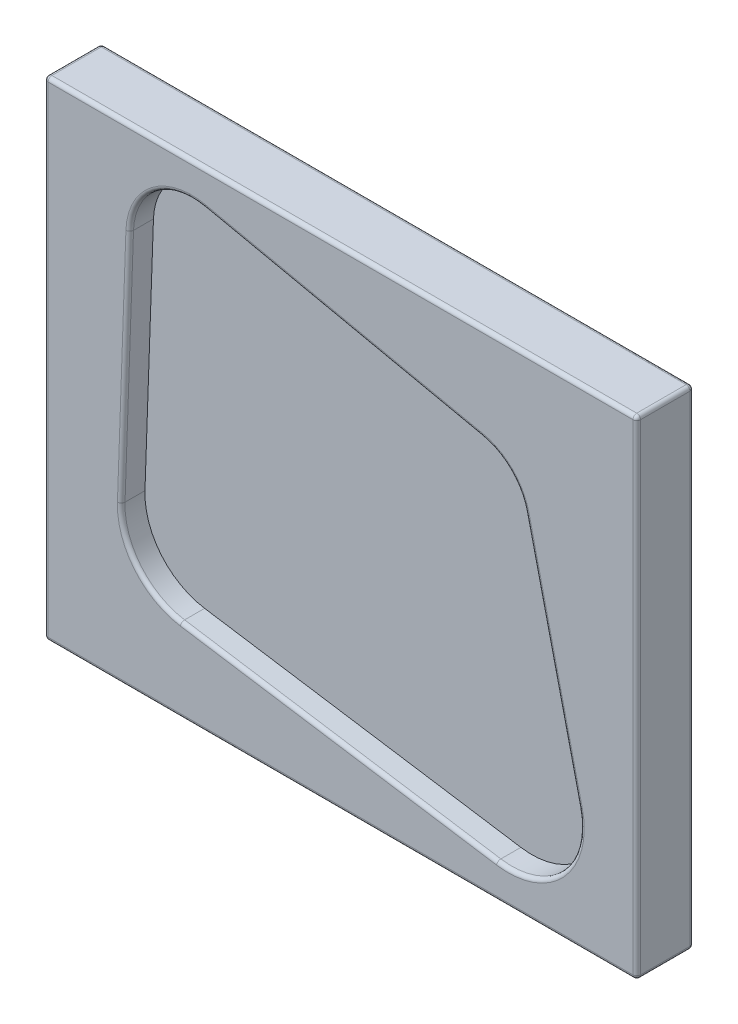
ISO-10303-21;
HEADER;
FILE_DESCRIPTION(('STEP AP214'),'2;1');
FILE_NAME('part.step','',(''),(''),'','','');
FILE_SCHEMA(('AUTOMOTIVE_DESIGN { 1 0 10303 214 1 1 1 1 }'));
ENDSEC;
DATA;
#1=APPLICATION_CONTEXT('core data for automotive mechanical design processes');
#2=APPLICATION_PROTOCOL_DEFINITION('international standard','automotive_design',2000,#1);
#3=PRODUCT_CONTEXT('',#1,'mechanical');
#4=PRODUCT('Part','Part','',(#3));
#5=PRODUCT_RELATED_PRODUCT_CATEGORY('part','',(#4));
#6=PRODUCT_DEFINITION_FORMATION('','',#4);
#7=PRODUCT_DEFINITION_CONTEXT('part definition',#1,'design');
#8=PRODUCT_DEFINITION('design','',#6,#7);
#9=PRODUCT_DEFINITION_SHAPE('','',#8);
#10=(LENGTH_UNIT() NAMED_UNIT(*) SI_UNIT(.MILLI.,.METRE.));
#11=(NAMED_UNIT(*) PLANE_ANGLE_UNIT() SI_UNIT($,.RADIAN.));
#12=(NAMED_UNIT(*) SI_UNIT($,.STERADIAN.) SOLID_ANGLE_UNIT());
#13=UNCERTAINTY_MEASURE_WITH_UNIT(LENGTH_MEASURE(1.E-05),#10,'distance_accuracy_value','');
#14=(GEOMETRIC_REPRESENTATION_CONTEXT(3) GLOBAL_UNCERTAINTY_ASSIGNED_CONTEXT((#13)) GLOBAL_UNIT_ASSIGNED_CONTEXT((#10,
#11,#12)) REPRESENTATION_CONTEXT('',''));
#15=CARTESIAN_POINT('',(0.,0.,0.));
#16=DIRECTION('',(0.,0.,1.));
#17=DIRECTION('',(1.,0.,0.));
#18=AXIS2_PLACEMENT_3D('',#15,#16,#17);
#19=CARTESIAN_POINT('',(128.820181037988,771.782439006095,-76.2));
#20=DIRECTION('',(-1.,0.,0.));
#21=DIRECTION('',(0.,-1.,0.));
#22=AXIS2_PLACEMENT_3D('',#19,#20,#21);
#23=PLANE('',#22);
#24=DIRECTION('',(0.,0.,1.));
#25=VECTOR('',#24,1.);
#26=CARTESIAN_POINT('',(128.820181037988,766.702439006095,-76.2));
#27=LINE('',#26,#25);
#28=CARTESIAN_POINT('',(128.820181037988,766.702439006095,-5.08));
#29=VERTEX_POINT('',#28);
#30=CARTESIAN_POINT('',(128.820181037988,766.702439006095,-71.12));
#31=VERTEX_POINT('',#30);
#32=EDGE_CURVE('E240',#29,#31,#27,.F.);
#33=ORIENTED_EDGE('',*,*,#32,.T.);
#34=DIRECTION('',(0.,-1.,0.));
#35=VECTOR('',#34,1.);
#36=CARTESIAN_POINT('',(128.820181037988,118.700669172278,-71.12));
#37=LINE('',#36,#35);
#38=CARTESIAN_POINT('',(128.820181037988,123.780669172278,-71.12));
#39=VERTEX_POINT('',#38);
#40=EDGE_CURVE('E262',#31,#39,#37,.T.);
#41=ORIENTED_EDGE('',*,*,#40,.T.);
#42=DIRECTION('',(0.,0.,1.));
#43=VECTOR('',#42,1.);
#44=CARTESIAN_POINT('',(128.820181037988,123.780669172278,-76.2));
#45=LINE('',#44,#43);
#46=CARTESIAN_POINT('',(128.820181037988,123.780669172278,-5.08));
#47=VERTEX_POINT('',#46);
#48=EDGE_CURVE('E260',#39,#47,#45,.T.);
#49=ORIENTED_EDGE('',*,*,#48,.T.);
#50=DIRECTION('',(0.,-1.,0.));
#51=VECTOR('',#50,1.);
#52=CARTESIAN_POINT('',(128.820181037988,771.782439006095,-5.08));
#53=LINE('',#52,#51);
#54=EDGE_CURVE('E258',#47,#29,#53,.F.);
#55=ORIENTED_EDGE('',*,*,#54,.T.);
#56=EDGE_LOOP('',(#33,#41,#49,#55));
#57=FACE_BOUND('',#56,.T.);
#58=ADVANCED_FACE('F31',(#57),#23,.T.);
#59=CARTESIAN_POINT('',(128.820181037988,771.782439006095,-76.2));
#60=DIRECTION('',(0.,1.,0.));
#61=DIRECTION('',(0.,0.,1.));
#62=AXIS2_PLACEMENT_3D('',#59,#60,#61);
#63=PLANE('',#62);
#64=DIRECTION('',(-1.,0.,0.));
#65=VECTOR('',#64,1.);
#66=CARTESIAN_POINT('',(128.820181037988,771.782439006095,-71.12));
#67=LINE('',#66,#65);
#68=CARTESIAN_POINT('',(916.003311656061,771.782439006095,-71.12));
#69=VERTEX_POINT('',#68);
#70=CARTESIAN_POINT('',(133.900181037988,771.782439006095,-71.12));
#71=VERTEX_POINT('',#70);
#72=EDGE_CURVE('E40',#69,#71,#67,.T.);
#73=ORIENTED_EDGE('',*,*,#72,.T.);
#74=DIRECTION('',(0.,0.,1.));
#75=VECTOR('',#74,1.);
#76=CARTESIAN_POINT('',(133.900181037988,771.782439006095,-76.2));
#77=LINE('',#76,#75);
#78=CARTESIAN_POINT('',(133.900181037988,771.782439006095,-5.08));
#79=VERTEX_POINT('',#78);
#80=EDGE_CURVE('E11',#71,#79,#77,.T.);
#81=ORIENTED_EDGE('',*,*,#80,.T.);
#82=DIRECTION('',(-1.,0.,0.));
#83=VECTOR('',#82,1.);
#84=CARTESIAN_POINT('',(128.820181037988,771.782439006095,-5.08));
#85=LINE('',#84,#83);
#86=CARTESIAN_POINT('',(916.003311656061,771.782439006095,-5.08));
#87=VERTEX_POINT('',#86);
#88=EDGE_CURVE('E333',#79,#87,#85,.F.);
#89=ORIENTED_EDGE('',*,*,#88,.T.);
#90=DIRECTION('',(0.,0.,1.));
#91=VECTOR('',#90,1.);
#92=CARTESIAN_POINT('',(916.003311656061,771.782439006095,-76.2));
#93=LINE('',#92,#91);
#94=EDGE_CURVE('E51',#87,#69,#93,.F.);
#95=ORIENTED_EDGE('',*,*,#94,.T.);
#96=EDGE_LOOP('',(#73,#81,#89,#95));
#97=FACE_BOUND('',#96,.T.);
#98=ADVANCED_FACE('F474',(#97),#63,.T.);
#99=CARTESIAN_POINT('',(921.083311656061,771.782439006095,-76.2));
#100=DIRECTION('',(1.,0.,0.));
#101=DIRECTION('',(0.,0.,-1.));
#102=AXIS2_PLACEMENT_3D('',#99,#100,#101);
#103=PLANE('',#102);
#104=DIRECTION('',(0.,0.,1.));
#105=VECTOR('',#104,1.);
#106=CARTESIAN_POINT('',(921.083311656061,123.780669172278,-76.2));
#107=LINE('',#106,#105);
#108=CARTESIAN_POINT('',(921.083311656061,123.780669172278,-5.08));
#109=VERTEX_POINT('',#108);
#110=CARTESIAN_POINT('',(921.083311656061,123.780669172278,-71.12));
#111=VERTEX_POINT('',#110);
#112=EDGE_CURVE('E328',#109,#111,#107,.F.);
#113=ORIENTED_EDGE('',*,*,#112,.T.);
#114=DIRECTION('',(0.,1.,0.));
#115=VECTOR('',#114,1.);
#116=CARTESIAN_POINT('',(921.083311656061,771.782439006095,-71.12));
#117=LINE('',#116,#115);
#118=CARTESIAN_POINT('',(921.083311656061,766.702439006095,-71.12));
#119=VERTEX_POINT('',#118);
#120=EDGE_CURVE('E330',#111,#119,#117,.T.);
#121=ORIENTED_EDGE('',*,*,#120,.T.);
#122=DIRECTION('',(0.,0.,1.));
#123=VECTOR('',#122,1.);
#124=CARTESIAN_POINT('',(921.083311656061,766.702439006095,-76.2));
#125=LINE('',#124,#123);
#126=CARTESIAN_POINT('',(921.083311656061,766.702439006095,-5.08));
#127=VERTEX_POINT('',#126);
#128=EDGE_CURVE('E324',#119,#127,#125,.T.);
#129=ORIENTED_EDGE('',*,*,#128,.T.);
#130=DIRECTION('',(0.,1.,0.));
#131=VECTOR('',#130,1.);
#132=CARTESIAN_POINT('',(921.083311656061,771.782439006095,-5.08));
#133=LINE('',#132,#131);
#134=EDGE_CURVE('E326',#127,#109,#133,.F.);
#135=ORIENTED_EDGE('',*,*,#134,.T.);
#136=EDGE_LOOP('',(#113,#121,#129,#135));
#137=FACE_BOUND('',#136,.T.);
#138=ADVANCED_FACE('F480',(#137),#103,.T.);
#139=CARTESIAN_POINT('',(128.820181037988,118.700669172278,-76.2));
#140=DIRECTION('',(0.,-1.,0.));
#141=DIRECTION('',(0.,0.,-1.));
#142=AXIS2_PLACEMENT_3D('',#139,#140,#141);
#143=PLANE('',#142);
#144=DIRECTION('',(0.,0.,1.));
#145=VECTOR('',#144,1.);
#146=CARTESIAN_POINT('',(133.900181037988,118.700669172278,-76.2));
#147=LINE('',#146,#145);
#148=CARTESIAN_POINT('',(133.900181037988,118.700669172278,-5.08));
#149=VERTEX_POINT('',#148);
#150=CARTESIAN_POINT('',(133.900181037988,118.700669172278,-71.12));
#151=VERTEX_POINT('',#150);
#152=EDGE_CURVE('E278',#149,#151,#147,.F.);
#153=ORIENTED_EDGE('',*,*,#152,.T.);
#154=DIRECTION('',(1.,0.,0.));
#155=VECTOR('',#154,1.);
#156=CARTESIAN_POINT('',(921.083311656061,118.700669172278,-71.12));
#157=LINE('',#156,#155);
#158=CARTESIAN_POINT('',(916.003311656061,118.700669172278,-71.12));
#159=VERTEX_POINT('',#158);
#160=EDGE_CURVE('E280',#151,#159,#157,.T.);
#161=ORIENTED_EDGE('',*,*,#160,.T.);
#162=DIRECTION('',(0.,0.,1.));
#163=VECTOR('',#162,1.);
#164=CARTESIAN_POINT('',(916.003311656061,118.700669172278,-76.2));
#165=LINE('',#164,#163);
#166=CARTESIAN_POINT('',(916.003311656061,118.700669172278,-5.08));
#167=VERTEX_POINT('',#166);
#168=EDGE_CURVE('E274',#159,#167,#165,.T.);
#169=ORIENTED_EDGE('',*,*,#168,.T.);
#170=DIRECTION('',(1.,0.,0.));
#171=VECTOR('',#170,1.);
#172=CARTESIAN_POINT('',(128.820181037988,118.700669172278,-5.08));
#173=LINE('',#172,#171);
#174=EDGE_CURVE('E276',#167,#149,#173,.F.);
#175=ORIENTED_EDGE('',*,*,#174,.T.);
#176=EDGE_LOOP('',(#153,#161,#169,#175));
#177=FACE_BOUND('',#176,.T.);
#178=ADVANCED_FACE('F484',(#177),#143,.T.);
#179=CARTESIAN_POINT('',(128.820181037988,118.700669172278,-76.2));
#180=DIRECTION('',(0.,0.,1.));
#181=DIRECTION('',(1.,0.,0.));
#182=AXIS2_PLACEMENT_3D('',#179,#180,#181);
#183=PLANE('',#182);
#184=DIRECTION('',(1.,0.,0.));
#185=VECTOR('',#184,1.);
#186=CARTESIAN_POINT('',(128.820181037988,123.780669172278,-76.2));
#187=LINE('',#186,#185);
#188=CARTESIAN_POINT('',(916.003311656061,123.780669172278,-76.2));
#189=VERTEX_POINT('',#188);
#190=CARTESIAN_POINT('',(133.900181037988,123.780669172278,-76.2));
#191=VERTEX_POINT('',#190);
#192=EDGE_CURVE('E269',#189,#191,#187,.F.);
#193=ORIENTED_EDGE('',*,*,#192,.T.);
#194=DIRECTION('',(0.,-1.,0.));
#195=VECTOR('',#194,1.);
#196=CARTESIAN_POINT('',(133.900181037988,771.782439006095,-76.2));
#197=LINE('',#196,#195);
#198=CARTESIAN_POINT('',(133.900181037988,766.702439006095,-76.2));
#199=VERTEX_POINT('',#198);
#200=EDGE_CURVE('E271',#191,#199,#197,.F.);
#201=ORIENTED_EDGE('',*,*,#200,.T.);
#202=DIRECTION('',(-1.,0.,0.));
#203=VECTOR('',#202,1.);
#204=CARTESIAN_POINT('',(921.083311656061,766.702439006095,-76.2));
#205=LINE('',#204,#203);
#206=CARTESIAN_POINT('',(916.003311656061,766.702439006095,-76.2));
#207=VERTEX_POINT('',#206);
#208=EDGE_CURVE('E265',#199,#207,#205,.F.);
#209=ORIENTED_EDGE('',*,*,#208,.T.);
#210=DIRECTION('',(0.,1.,0.));
#211=VECTOR('',#210,1.);
#212=CARTESIAN_POINT('',(916.003311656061,118.700669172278,-76.2));
#213=LINE('',#212,#211);
#214=EDGE_CURVE('E267',#207,#189,#213,.F.);
#215=ORIENTED_EDGE('',*,*,#214,.T.);
#216=EDGE_LOOP('',(#193,#201,#209,#215));
#217=FACE_BOUND('',#216,.T.);
#218=ADVANCED_FACE('F729',(#217),#183,.F.);
#219=CARTESIAN_POINT('',(128.820181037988,118.700669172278,0.));
#220=DIRECTION('',(0.,0.,1.));
#221=DIRECTION('',(1.,0.,0.));
#222=AXIS2_PLACEMENT_3D('',#219,#220,#221);
#223=PLANE('',#222);
#224=CARTESIAN_POINT('',(325.83500035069,323.166907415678,0.));
#225=DIRECTION('',(0.,0.,1.));
#226=DIRECTION('',(1.,0.,0.));
#227=AXIS2_PLACEMENT_3D('',#224,#225,#226);
#228=CIRCLE('',#227,99.272049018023);
#229=CARTESIAN_POINT('',(310.670317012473,225.059965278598,0.));
#230=VERTEX_POINT('',#229);
#231=CARTESIAN_POINT('',(226.625167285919,326.680984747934,0.));
#232=VERTEX_POINT('',#231);
#233=EDGE_CURVE('E304',#230,#232,#228,.F.);
#234=ORIENTED_EDGE('',*,*,#233,.T.);
#235=DIRECTION('',(-0.0353984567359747,-0.999373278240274,0.));
#236=VECTOR('',#235,1.);
#237=CARTESIAN_POINT('',(237.975693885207,647.130349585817,0.));
#238=LINE('',#237,#236);
#239=CARTESIAN_POINT('',(237.975693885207,647.130349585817,0.));
#240=VERTEX_POINT('',#239);
#241=EDGE_CURVE('E306',#232,#240,#238,.F.);
#242=ORIENTED_EDGE('',*,*,#241,.T.);
#243=CARTESIAN_POINT('',(325.83500035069,644.018315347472,0.));
#244=DIRECTION('',(0.,0.,1.));
#245=DIRECTION('',(1.,0.,0.));
#246=AXIS2_PLACEMENT_3D('',#243,#244,#245);
#247=CIRCLE('',#246,87.9144043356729);
#248=CARTESIAN_POINT('',(344.256945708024,729.980949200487,0.));
#249=VERTEX_POINT('',#248);
#250=EDGE_CURVE('E292',#240,#249,#247,.F.);
#251=ORIENTED_EDGE('',*,*,#250,.T.);
#252=DIRECTION('',(-0.977799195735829,0.209544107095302,0.));
#253=VECTOR('',#252,1.);
#254=CARTESIAN_POINT('',(714.936912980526,650.543572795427,0.));
#255=LINE('',#254,#253);
#256=CARTESIAN_POINT('',(714.936912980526,650.543572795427,0.));
#257=VERTEX_POINT('',#256);
#258=EDGE_CURVE('E294',#249,#257,#255,.F.);
#259=ORIENTED_EDGE('',*,*,#258,.T.);
#260=CARTESIAN_POINT('',(697.941392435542,571.237089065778,0.));
#261=DIRECTION('',(0.,0.,1.));
#262=DIRECTION('',(1.,0.,0.));
#263=AXIS2_PLACEMENT_3D('',#260,#261,#262);
#264=CIRCLE('',#263,81.1071271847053);
#265=CARTESIAN_POINT('',(776.937721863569,589.620397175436,0.));
#266=VERTEX_POINT('',#265);
#267=EDGE_CURVE('E296',#257,#266,#264,.F.);
#268=ORIENTED_EDGE('',*,*,#267,.T.);
#269=DIRECTION('',(-0.226654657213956,0.973975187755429,0.));
#270=VECTOR('',#269,1.);
#271=CARTESIAN_POINT('',(848.223148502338,283.294298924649,0.));
#272=LINE('',#271,#270);
#273=CARTESIAN_POINT('',(848.223148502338,283.294298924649,0.));
#274=VERTEX_POINT('',#273);
#275=EDGE_CURVE('E298',#266,#274,#272,.F.);
#276=ORIENTED_EDGE('',*,*,#275,.T.);
#277=CARTESIAN_POINT('',(749.130631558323,260.234388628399,0.));
#278=DIRECTION('',(0.,0.,1.));
#279=DIRECTION('',(1.,0.,0.));
#280=AXIS2_PLACEMENT_3D('',#277,#278,#279);
#281=CIRCLE('',#280,101.740288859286);
#282=CARTESIAN_POINT('',(733.588902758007,159.688175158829,0.));
#283=VERTEX_POINT('',#282);
#284=EDGE_CURVE('E300',#274,#283,#281,.F.);
#285=ORIENTED_EDGE('',*,*,#284,.T.);
#286=DIRECTION('',(0.988263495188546,-0.152758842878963,0.));
#287=VECTOR('',#286,1.);
#288=CARTESIAN_POINT('',(310.670317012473,225.059965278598,0.));
#289=LINE('',#288,#287);
#290=EDGE_CURVE('E302',#283,#230,#289,.F.);
#291=ORIENTED_EDGE('',*,*,#290,.T.);
#292=EDGE_LOOP('',(#234,#242,#251,#259,#268,#276,#285,#291));
#293=FACE_BOUND('',#292,.T.);
#294=DIRECTION('',(0.,-1.,0.));
#295=VECTOR('',#294,1.);
#296=CARTESIAN_POINT('',(133.900181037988,118.700669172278,0.));
#297=LINE('',#296,#295);
#298=CARTESIAN_POINT('',(133.900181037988,766.702439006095,0.));
#299=VERTEX_POINT('',#298);
#300=CARTESIAN_POINT('',(133.900181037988,123.780669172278,0.));
#301=VERTEX_POINT('',#300);
#302=EDGE_CURVE('E287',#299,#301,#297,.T.);
#303=ORIENTED_EDGE('',*,*,#302,.T.);
#304=DIRECTION('',(1.,0.,0.));
#305=VECTOR('',#304,1.);
#306=CARTESIAN_POINT('',(128.820181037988,123.780669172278,0.));
#307=LINE('',#306,#305);
#308=CARTESIAN_POINT('',(916.003311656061,123.780669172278,0.));
#309=VERTEX_POINT('',#308);
#310=EDGE_CURVE('E289',#301,#309,#307,.T.);
#311=ORIENTED_EDGE('',*,*,#310,.T.);
#312=DIRECTION('',(0.,1.,0.));
#313=VECTOR('',#312,1.);
#314=CARTESIAN_POINT('',(916.003311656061,118.700669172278,0.));
#315=LINE('',#314,#313);
#316=CARTESIAN_POINT('',(916.003311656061,766.702439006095,0.));
#317=VERTEX_POINT('',#316);
#318=EDGE_CURVE('E285',#309,#317,#315,.T.);
#319=ORIENTED_EDGE('',*,*,#318,.T.);
#320=DIRECTION('',(-1.,0.,0.));
#321=VECTOR('',#320,1.);
#322=CARTESIAN_POINT('',(128.820181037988,766.702439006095,0.));
#323=LINE('',#322,#321);
#324=EDGE_CURVE('E283',#317,#299,#323,.T.);
#325=ORIENTED_EDGE('',*,*,#324,.T.);
#326=EDGE_LOOP('',(#303,#311,#319,#325));
#327=FACE_BOUND('',#326,.T.);
#328=ADVANCED_FACE('F431',(#293,#327),#223,.T.);
#329=CARTESIAN_POINT('',(325.83500035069,644.018315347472,-31.75));
#330=DIRECTION('',(0.,0.,1.));
#331=DIRECTION('',(1.,0.,0.));
#332=AXIS2_PLACEMENT_3D('',#329,#330,#331);
#333=CYLINDRICAL_SURFACE('',#332,82.8344043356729);
#334=DIRECTION('',(0.,0.,1.));
#335=VECTOR('',#334,1.);
#336=CARTESIAN_POINT('',(343.19246164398,725.013729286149,-31.75));
#337=LINE('',#336,#335);
#338=CARTESIAN_POINT('',(343.19246164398,725.013729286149,-31.75));
#339=VERTEX_POINT('',#338);
#340=CARTESIAN_POINT('',(343.19246164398,725.013729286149,-5.08));
#341=VERTEX_POINT('',#340);
#342=EDGE_CURVE('E238',#339,#341,#337,.T.);
#343=ORIENTED_EDGE('',*,*,#342,.T.);
#344=CARTESIAN_POINT('',(325.83500035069,644.018315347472,-5.08));
#345=DIRECTION('',(0.,0.,1.));
#346=DIRECTION('',(1.,0.,0.));
#347=AXIS2_PLACEMENT_3D('',#344,#345,#346);
#348=CIRCLE('',#347,82.8344043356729);
#349=CARTESIAN_POINT('',(243.052510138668,646.950525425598,-5.08));
#350=VERTEX_POINT('',#349);
#351=EDGE_CURVE('E200',#341,#350,#348,.T.);
#352=ORIENTED_EDGE('',*,*,#351,.T.);
#353=DIRECTION('',(0.,0.,1.));
#354=VECTOR('',#353,1.);
#355=CARTESIAN_POINT('',(243.052510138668,646.950525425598,-31.75));
#356=LINE('',#355,#354);
#357=CARTESIAN_POINT('',(243.052510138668,646.950525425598,-31.75));
#358=VERTEX_POINT('',#357);
#359=EDGE_CURVE('E192',#358,#350,#356,.T.);
#360=ORIENTED_EDGE('',*,*,#359,.F.);
#361=CARTESIAN_POINT('',(325.83500035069,644.018315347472,-31.75));
#362=DIRECTION('',(0.,0.,1.));
#363=DIRECTION('',(1.,0.,0.));
#364=AXIS2_PLACEMENT_3D('',#361,#362,#363);
#365=CIRCLE('',#364,82.8344043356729);
#366=EDGE_CURVE('E197',#339,#358,#365,.T.);
#367=ORIENTED_EDGE('',*,*,#366,.F.);
#368=EDGE_LOOP('',(#343,#352,#360,#367));
#369=FACE_BOUND('',#368,.T.);
#370=ADVANCED_FACE('F195',(#369),#333,.F.);
#371=CARTESIAN_POINT('',(713.872428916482,645.576352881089,-31.75));
#372=DIRECTION('',(0.209544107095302,0.977799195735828,0.));
#373=DIRECTION('',(-0.977799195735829,0.209544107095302,0.));
#374=AXIS2_PLACEMENT_3D('',#371,#372,#373);
#375=PLANE('',#374);
#376=DIRECTION('',(0.,0.,1.));
#377=VECTOR('',#376,1.);
#378=CARTESIAN_POINT('',(713.872428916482,645.576352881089,-31.75));
#379=LINE('',#378,#377);
#380=CARTESIAN_POINT('',(713.872428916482,645.576352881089,-31.75));
#381=VERTEX_POINT('',#380);
#382=CARTESIAN_POINT('',(713.872428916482,645.576352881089,-5.08));
#383=VERTEX_POINT('',#382);
#384=EDGE_CURVE('E241',#381,#383,#379,.T.);
#385=ORIENTED_EDGE('',*,*,#384,.T.);
#386=DIRECTION('',(-0.977799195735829,0.209544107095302,0.));
#387=VECTOR('',#386,1.);
#388=CARTESIAN_POINT('',(343.192461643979,725.013729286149,-5.08));
#389=LINE('',#388,#387);
#390=EDGE_CURVE('E321',#383,#341,#389,.T.);
#391=ORIENTED_EDGE('',*,*,#390,.T.);
#392=ORIENTED_EDGE('',*,*,#342,.F.);
#393=DIRECTION('',(-0.977799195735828,0.209544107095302,0.));
#394=VECTOR('',#393,1.);
#395=CARTESIAN_POINT('',(713.872428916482,645.576352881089,-31.75));
#396=LINE('',#395,#394);
#397=EDGE_CURVE('E205',#381,#339,#396,.T.);
#398=ORIENTED_EDGE('',*,*,#397,.F.);
#399=EDGE_LOOP('',(#385,#391,#392,#398));
#400=FACE_BOUND('',#399,.T.);
#401=ADVANCED_FACE('F463',(#400),#375,.F.);
#402=CARTESIAN_POINT('',(697.941392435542,571.237089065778,-31.75));
#403=DIRECTION('',(0.,0.,1.));
#404=DIRECTION('',(1.,0.,0.));
#405=AXIS2_PLACEMENT_3D('',#402,#403,#404);
#406=CYLINDRICAL_SURFACE('',#405,76.0271271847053);
#407=DIRECTION('',(0.,0.,1.));
#408=VECTOR('',#407,1.);
#409=CARTESIAN_POINT('',(771.989927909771,588.46899151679,-31.75));
#410=LINE('',#409,#408);
#411=CARTESIAN_POINT('',(771.989927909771,588.46899151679,-31.75));
#412=VERTEX_POINT('',#411);
#413=CARTESIAN_POINT('',(771.989927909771,588.46899151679,-5.08));
#414=VERTEX_POINT('',#413);
#415=EDGE_CURVE('E244',#412,#414,#410,.T.);
#416=ORIENTED_EDGE('',*,*,#415,.T.);
#417=CARTESIAN_POINT('',(697.941392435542,571.237089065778,-5.08));
#418=DIRECTION('',(0.,0.,1.));
#419=DIRECTION('',(1.,0.,0.));
#420=AXIS2_PLACEMENT_3D('',#417,#418,#419);
#421=CIRCLE('',#420,76.0271271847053);
#422=EDGE_CURVE('E319',#414,#383,#421,.T.);
#423=ORIENTED_EDGE('',*,*,#422,.T.);
#424=ORIENTED_EDGE('',*,*,#384,.F.);
#425=CARTESIAN_POINT('',(697.941392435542,571.237089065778,-31.75));
#426=DIRECTION('',(0.,0.,1.));
#427=DIRECTION('',(1.,0.,0.));
#428=AXIS2_PLACEMENT_3D('',#425,#426,#427);
#429=CIRCLE('',#428,76.0271271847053);
#430=EDGE_CURVE('E235',#412,#381,#429,.T.);
#431=ORIENTED_EDGE('',*,*,#430,.F.);
#432=EDGE_LOOP('',(#416,#423,#424,#431));
#433=FACE_BOUND('',#432,.T.);
#434=ADVANCED_FACE('F464',(#433),#406,.F.);
#435=CARTESIAN_POINT('',(843.27535454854,282.142893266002,-31.75));
#436=DIRECTION('',(0.973975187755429,0.226654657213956,0.));
#437=DIRECTION('',(-0.226654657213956,0.973975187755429,0.));
#438=AXIS2_PLACEMENT_3D('',#435,#436,#437);
#439=PLANE('',#438);
#440=DIRECTION('',(0.,0.,1.));
#441=VECTOR('',#440,1.);
#442=CARTESIAN_POINT('',(843.27535454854,282.142893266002,-31.75));
#443=LINE('',#442,#441);
#444=CARTESIAN_POINT('',(843.27535454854,282.142893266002,-31.75));
#445=VERTEX_POINT('',#444);
#446=CARTESIAN_POINT('',(843.27535454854,282.142893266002,-5.08));
#447=VERTEX_POINT('',#446);
#448=EDGE_CURVE('E247',#445,#447,#443,.T.);
#449=ORIENTED_EDGE('',*,*,#448,.T.);
#450=DIRECTION('',(-0.226654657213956,0.973975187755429,0.));
#451=VECTOR('',#450,1.);
#452=CARTESIAN_POINT('',(771.989927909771,588.46899151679,-5.08));
#453=LINE('',#452,#451);
#454=EDGE_CURVE('E317',#447,#414,#453,.T.);
#455=ORIENTED_EDGE('',*,*,#454,.T.);
#456=ORIENTED_EDGE('',*,*,#415,.F.);
#457=DIRECTION('',(-0.226654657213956,0.973975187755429,0.));
#458=VECTOR('',#457,1.);
#459=CARTESIAN_POINT('',(843.27535454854,282.142893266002,-31.75));
#460=LINE('',#459,#458);
#461=EDGE_CURVE('E232',#445,#412,#460,.T.);
#462=ORIENTED_EDGE('',*,*,#461,.F.);
#463=EDGE_LOOP('',(#449,#455,#456,#462));
#464=FACE_BOUND('',#463,.T.);
#465=ADVANCED_FACE('F459',(#464),#439,.F.);
#466=CARTESIAN_POINT('',(749.130631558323,260.234388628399,-31.75));
#467=DIRECTION('',(0.,0.,1.));
#468=DIRECTION('',(1.,0.,0.));
#469=AXIS2_PLACEMENT_3D('',#466,#467,#468);
#470=CYLINDRICAL_SURFACE('',#469,96.660288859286);
#471=DIRECTION('',(0.,0.,1.));
#472=VECTOR('',#471,1.);
#473=CARTESIAN_POINT('',(734.364917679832,164.708553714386,-31.75));
#474=LINE('',#473,#472);
#475=CARTESIAN_POINT('',(734.364917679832,164.708553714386,-31.75));
#476=VERTEX_POINT('',#475);
#477=CARTESIAN_POINT('',(734.364917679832,164.708553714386,-5.08));
#478=VERTEX_POINT('',#477);
#479=EDGE_CURVE('E250',#476,#478,#474,.T.);
#480=ORIENTED_EDGE('',*,*,#479,.T.);
#481=CARTESIAN_POINT('',(749.130631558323,260.234388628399,-5.08));
#482=DIRECTION('',(0.,0.,1.));
#483=DIRECTION('',(1.,0.,0.));
#484=AXIS2_PLACEMENT_3D('',#481,#482,#483);
#485=CIRCLE('',#484,96.660288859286);
#486=EDGE_CURVE('E315',#478,#447,#485,.T.);
#487=ORIENTED_EDGE('',*,*,#486,.T.);
#488=ORIENTED_EDGE('',*,*,#448,.F.);
#489=CARTESIAN_POINT('',(749.130631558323,260.234388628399,-31.75));
#490=DIRECTION('',(0.,0.,1.));
#491=DIRECTION('',(1.,0.,0.));
#492=AXIS2_PLACEMENT_3D('',#489,#490,#491);
#493=CIRCLE('',#492,96.660288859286);
#494=EDGE_CURVE('E229',#476,#445,#493,.T.);
#495=ORIENTED_EDGE('',*,*,#494,.F.);
#496=EDGE_LOOP('',(#480,#487,#488,#495));
#497=FACE_BOUND('',#496,.T.);
#498=ADVANCED_FACE('F456',(#497),#470,.F.);
#499=CARTESIAN_POINT('',(311.446331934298,230.080343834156,-31.75));
#500=DIRECTION('',(-0.152758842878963,-0.988263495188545,0.));
#501=DIRECTION('',(0.988263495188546,-0.152758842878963,0.));
#502=AXIS2_PLACEMENT_3D('',#499,#500,#501);
#503=PLANE('',#502);
#504=DIRECTION('',(0.,0.,1.));
#505=VECTOR('',#504,1.);
#506=CARTESIAN_POINT('',(311.446331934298,230.080343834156,-31.75));
#507=LINE('',#506,#505);
#508=CARTESIAN_POINT('',(311.446331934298,230.080343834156,-31.75));
#509=VERTEX_POINT('',#508);
#510=CARTESIAN_POINT('',(311.446331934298,230.080343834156,-5.08));
#511=VERTEX_POINT('',#510);
#512=EDGE_CURVE('E253',#509,#511,#507,.T.);
#513=ORIENTED_EDGE('',*,*,#512,.T.);
#514=DIRECTION('',(0.988263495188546,-0.152758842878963,0.));
#515=VECTOR('',#514,1.);
#516=CARTESIAN_POINT('',(734.364917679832,164.708553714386,-5.08));
#517=LINE('',#516,#515);
#518=EDGE_CURVE('E313',#511,#478,#517,.T.);
#519=ORIENTED_EDGE('',*,*,#518,.T.);
#520=ORIENTED_EDGE('',*,*,#479,.F.);
#521=DIRECTION('',(0.988263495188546,-0.152758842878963,0.));
#522=VECTOR('',#521,1.);
#523=CARTESIAN_POINT('',(311.446331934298,230.080343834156,-31.75));
#524=LINE('',#523,#522);
#525=EDGE_CURVE('E226',#509,#476,#524,.T.);
#526=ORIENTED_EDGE('',*,*,#525,.F.);
#527=EDGE_LOOP('',(#513,#519,#520,#526));
#528=FACE_BOUND('',#527,.T.);
#529=ADVANCED_FACE('F453',(#528),#503,.F.);
#530=CARTESIAN_POINT('',(325.83500035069,323.166907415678,-31.75));
#531=DIRECTION('',(0.,0.,1.));
#532=DIRECTION('',(1.,0.,0.));
#533=AXIS2_PLACEMENT_3D('',#530,#531,#532);
#534=CYLINDRICAL_SURFACE('',#533,94.192049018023);
#535=DIRECTION('',(0.,0.,1.));
#536=VECTOR('',#535,1.);
#537=CARTESIAN_POINT('',(231.70198353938,326.501160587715,-31.75));
#538=LINE('',#537,#536);
#539=CARTESIAN_POINT('',(231.70198353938,326.501160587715,-31.75));
#540=VERTEX_POINT('',#539);
#541=CARTESIAN_POINT('',(231.70198353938,326.501160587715,-5.08));
#542=VERTEX_POINT('',#541);
#543=EDGE_CURVE('E204',#540,#542,#538,.T.);
#544=ORIENTED_EDGE('',*,*,#543,.T.);
#545=CARTESIAN_POINT('',(325.83500035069,323.166907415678,-5.08));
#546=DIRECTION('',(0.,0.,1.));
#547=DIRECTION('',(1.,0.,0.));
#548=AXIS2_PLACEMENT_3D('',#545,#546,#547);
#549=CIRCLE('',#548,94.192049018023);
#550=EDGE_CURVE('E311',#542,#511,#549,.T.);
#551=ORIENTED_EDGE('',*,*,#550,.T.);
#552=ORIENTED_EDGE('',*,*,#512,.F.);
#553=CARTESIAN_POINT('',(325.83500035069,323.166907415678,-31.75));
#554=DIRECTION('',(0.,0.,1.));
#555=DIRECTION('',(1.,0.,0.));
#556=AXIS2_PLACEMENT_3D('',#553,#554,#555);
#557=CIRCLE('',#556,94.192049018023);
#558=EDGE_CURVE('E214',#540,#509,#557,.T.);
#559=ORIENTED_EDGE('',*,*,#558,.F.);
#560=EDGE_LOOP('',(#544,#551,#552,#559));
#561=FACE_BOUND('',#560,.T.);
#562=ADVANCED_FACE('F449',(#561),#534,.F.);
#563=CARTESIAN_POINT('',(243.052510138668,646.950525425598,-31.75));
#564=DIRECTION('',(-0.999373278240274,0.0353984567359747,0.));
#565=DIRECTION('',(-0.0353984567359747,-0.999373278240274,0.));
#566=AXIS2_PLACEMENT_3D('',#563,#564,#565);
#567=PLANE('',#566);
#568=ORIENTED_EDGE('',*,*,#359,.T.);
#569=DIRECTION('',(-0.0353984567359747,-0.999373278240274,0.));
#570=VECTOR('',#569,1.);
#571=CARTESIAN_POINT('',(231.70198353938,326.501160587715,-5.08));
#572=LINE('',#571,#570);
#573=EDGE_CURVE('E309',#350,#542,#572,.T.);
#574=ORIENTED_EDGE('',*,*,#573,.T.);
#575=ORIENTED_EDGE('',*,*,#543,.F.);
#576=DIRECTION('',(-0.0353984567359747,-0.999373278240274,0.));
#577=VECTOR('',#576,1.);
#578=CARTESIAN_POINT('',(243.052510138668,646.950525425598,-31.75));
#579=LINE('',#578,#577);
#580=EDGE_CURVE('E208',#358,#540,#579,.T.);
#581=ORIENTED_EDGE('',*,*,#580,.F.);
#582=EDGE_LOOP('',(#568,#574,#575,#581));
#583=FACE_BOUND('',#582,.T.);
#584=ADVANCED_FACE('F209',(#583),#567,.F.);
#585=CARTESIAN_POINT('',(325.83500035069,644.018315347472,-31.75));
#586=DIRECTION('',(0.,0.,1.));
#587=DIRECTION('',(1.,0.,0.));
#588=AXIS2_PLACEMENT_3D('',#585,#586,#587);
#589=PLANE('',#588);
#590=ORIENTED_EDGE('',*,*,#366,.T.);
#591=ORIENTED_EDGE('',*,*,#580,.T.);
#592=ORIENTED_EDGE('',*,*,#558,.T.);
#593=ORIENTED_EDGE('',*,*,#525,.T.);
#594=ORIENTED_EDGE('',*,*,#494,.T.);
#595=ORIENTED_EDGE('',*,*,#461,.T.);
#596=ORIENTED_EDGE('',*,*,#430,.T.);
#597=ORIENTED_EDGE('',*,*,#397,.T.);
#598=EDGE_LOOP('',(#590,#591,#592,#593,#594,#595,#596,#597));
#599=FACE_BOUND('',#598,.T.);
#600=ADVANCED_FACE('F216',(#599),#589,.T.);
#601=CARTESIAN_POINT('',(916.003311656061,118.700669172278,-5.08));
#602=DIRECTION('',(0.,1.,0.));
#603=DIRECTION('',(0.,0.,1.));
#604=AXIS2_PLACEMENT_3D('',#601,#602,#603);
#605=CYLINDRICAL_SURFACE('',#604,5.08);
#606=CARTESIAN_POINT('',(916.003311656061,766.702439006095,-5.08));
#607=DIRECTION('',(0.,1.,0.));
#608=DIRECTION('',(0.,0.,1.));
#609=AXIS2_PLACEMENT_3D('',#606,#607,#608);
#610=CIRCLE('',#609,5.08);
#611=EDGE_CURVE('E219',#317,#127,#610,.T.);
#612=ORIENTED_EDGE('',*,*,#611,.F.);
#613=ORIENTED_EDGE('',*,*,#318,.F.);
#614=CARTESIAN_POINT('',(916.003311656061,123.780669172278,-5.08));
#615=DIRECTION('',(0.,-1.,0.));
#616=DIRECTION('',(0.,0.,-1.));
#617=AXIS2_PLACEMENT_3D('',#614,#615,#616);
#618=CIRCLE('',#617,5.08);
#619=EDGE_CURVE('E222',#109,#309,#618,.T.);
#620=ORIENTED_EDGE('',*,*,#619,.F.);
#621=ORIENTED_EDGE('',*,*,#134,.F.);
#622=EDGE_LOOP('',(#612,#613,#620,#621));
#623=FACE_BOUND('',#622,.T.);
#624=ADVANCED_FACE('F561',(#623),#605,.T.);
#625=CARTESIAN_POINT('',(916.003311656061,766.702439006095,-5.08));
#626=DIRECTION('',(0.,0.,1.));
#627=DIRECTION('',(1.,0.,0.));
#628=AXIS2_PLACEMENT_3D('',#625,#626,#627);
#629=SPHERICAL_SURFACE('',#628,5.08);
#630=CARTESIAN_POINT('',(916.003311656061,766.702439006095,-5.08));
#631=DIRECTION('',(1.,0.,0.));
#632=DIRECTION('',(0.,0.,-1.));
#633=AXIS2_PLACEMENT_3D('',#630,#631,#632);
#634=CIRCLE('',#633,5.08);
#635=EDGE_CURVE('E391',#317,#87,#634,.F.);
#636=ORIENTED_EDGE('',*,*,#635,.F.);
#637=ORIENTED_EDGE('',*,*,#611,.T.);
#638=CARTESIAN_POINT('',(916.003311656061,766.702439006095,-5.08));
#639=DIRECTION('',(0.,0.,1.));
#640=DIRECTION('',(1.,0.,0.));
#641=AXIS2_PLACEMENT_3D('',#638,#639,#640);
#642=CIRCLE('',#641,5.08);
#643=EDGE_CURVE('E394',#87,#127,#642,.F.);
#644=ORIENTED_EDGE('',*,*,#643,.F.);
#645=EDGE_LOOP('',(#636,#637,#644));
#646=FACE_BOUND('',#645,.T.);
#647=ADVANCED_FACE('F557',(#646),#629,.T.);
#648=CARTESIAN_POINT('',(916.003311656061,123.780669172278,-5.08));
#649=DIRECTION('',(0.,0.,1.));
#650=DIRECTION('',(1.,0.,0.));
#651=AXIS2_PLACEMENT_3D('',#648,#649,#650);
#652=SPHERICAL_SURFACE('',#651,5.08);
#653=CARTESIAN_POINT('',(916.003311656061,123.780669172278,-5.08));
#654=DIRECTION('',(0.,0.,1.));
#655=DIRECTION('',(1.,0.,0.));
#656=AXIS2_PLACEMENT_3D('',#653,#654,#655);
#657=CIRCLE('',#656,5.08);
#658=EDGE_CURVE('E386',#109,#167,#657,.F.);
#659=ORIENTED_EDGE('',*,*,#658,.F.);
#660=ORIENTED_EDGE('',*,*,#619,.T.);
#661=CARTESIAN_POINT('',(916.003311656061,123.780669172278,-5.08));
#662=DIRECTION('',(1.,0.,0.));
#663=DIRECTION('',(0.,0.,-1.));
#664=AXIS2_PLACEMENT_3D('',#661,#662,#663);
#665=CIRCLE('',#664,5.08);
#666=EDGE_CURVE('E389',#167,#309,#665,.F.);
#667=ORIENTED_EDGE('',*,*,#666,.F.);
#668=EDGE_LOOP('',(#659,#660,#667));
#669=FACE_BOUND('',#668,.T.);
#670=ADVANCED_FACE('F553',(#669),#652,.T.);
#671=CARTESIAN_POINT('',(916.003311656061,766.702439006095,-76.2));
#672=DIRECTION('',(0.,0.,1.));
#673=DIRECTION('',(1.,0.,0.));
#674=AXIS2_PLACEMENT_3D('',#671,#672,#673);
#675=CYLINDRICAL_SURFACE('',#674,5.08);
#676=ORIENTED_EDGE('',*,*,#643,.T.);
#677=ORIENTED_EDGE('',*,*,#128,.F.);
#678=CARTESIAN_POINT('',(916.003311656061,766.702439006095,-71.12));
#679=DIRECTION('',(0.,0.,-1.));
#680=DIRECTION('',(-1.,0.,0.));
#681=AXIS2_PLACEMENT_3D('',#678,#679,#680);
#682=CIRCLE('',#681,5.08);
#683=EDGE_CURVE('E381',#69,#119,#682,.T.);
#684=ORIENTED_EDGE('',*,*,#683,.F.);
#685=ORIENTED_EDGE('',*,*,#94,.F.);
#686=EDGE_LOOP('',(#676,#677,#684,#685));
#687=FACE_BOUND('',#686,.T.);
#688=ADVANCED_FACE('F549',(#687),#675,.T.);
#689=CARTESIAN_POINT('',(128.820181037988,766.702439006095,-5.08));
#690=DIRECTION('',(-1.,0.,0.));
#691=DIRECTION('',(0.,0.,1.));
#692=AXIS2_PLACEMENT_3D('',#689,#690,#691);
#693=CYLINDRICAL_SURFACE('',#692,5.08);
#694=ORIENTED_EDGE('',*,*,#635,.T.);
#695=ORIENTED_EDGE('',*,*,#88,.F.);
#696=CARTESIAN_POINT('',(133.900181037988,766.702439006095,-5.08));
#697=DIRECTION('',(-1.,0.,0.));
#698=DIRECTION('',(0.,0.,1.));
#699=AXIS2_PLACEMENT_3D('',#696,#697,#698);
#700=CIRCLE('',#699,5.08);
#701=EDGE_CURVE('E378',#299,#79,#700,.T.);
#702=ORIENTED_EDGE('',*,*,#701,.F.);
#703=ORIENTED_EDGE('',*,*,#324,.F.);
#704=EDGE_LOOP('',(#694,#695,#702,#703));
#705=FACE_BOUND('',#704,.T.);
#706=ADVANCED_FACE('F545',(#705),#693,.T.);
#707=CARTESIAN_POINT('',(133.900181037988,118.700669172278,-5.08));
#708=DIRECTION('',(0.,-1.,0.));
#709=DIRECTION('',(1.,0.,0.));
#710=AXIS2_PLACEMENT_3D('',#707,#708,#709);
#711=CYLINDRICAL_SURFACE('',#710,5.08);
#712=CARTESIAN_POINT('',(133.900181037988,123.780669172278,-5.08));
#713=DIRECTION('',(0.,-1.,0.));
#714=DIRECTION('',(1.,0.,0.));
#715=AXIS2_PLACEMENT_3D('',#712,#713,#714);
#716=CIRCLE('',#715,5.08);
#717=EDGE_CURVE('E372',#301,#47,#716,.T.);
#718=ORIENTED_EDGE('',*,*,#717,.F.);
#719=ORIENTED_EDGE('',*,*,#302,.F.);
#720=CARTESIAN_POINT('',(133.900181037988,766.702439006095,-5.08));
#721=DIRECTION('',(0.,1.,0.));
#722=DIRECTION('',(0.,0.,1.));
#723=AXIS2_PLACEMENT_3D('',#720,#721,#722);
#724=CIRCLE('',#723,5.08);
#725=EDGE_CURVE('E375',#29,#299,#724,.T.);
#726=ORIENTED_EDGE('',*,*,#725,.F.);
#727=ORIENTED_EDGE('',*,*,#54,.F.);
#728=EDGE_LOOP('',(#718,#719,#726,#727));
#729=FACE_BOUND('',#728,.T.);
#730=ADVANCED_FACE('F541',(#729),#711,.T.);
#731=CARTESIAN_POINT('',(128.820181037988,123.780669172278,-5.08));
#732=DIRECTION('',(1.,0.,0.));
#733=DIRECTION('',(0.,0.,-1.));
#734=AXIS2_PLACEMENT_3D('',#731,#732,#733);
#735=CYLINDRICAL_SURFACE('',#734,5.08);
#736=ORIENTED_EDGE('',*,*,#666,.T.);
#737=ORIENTED_EDGE('',*,*,#310,.F.);
#738=CARTESIAN_POINT('',(133.900181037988,123.780669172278,-5.08));
#739=DIRECTION('',(-1.,0.,0.));
#740=DIRECTION('',(0.,0.,1.));
#741=AXIS2_PLACEMENT_3D('',#738,#739,#740);
#742=CIRCLE('',#741,5.08);
#743=EDGE_CURVE('E369',#149,#301,#742,.T.);
#744=ORIENTED_EDGE('',*,*,#743,.F.);
#745=ORIENTED_EDGE('',*,*,#174,.F.);
#746=EDGE_LOOP('',(#736,#737,#744,#745));
#747=FACE_BOUND('',#746,.T.);
#748=ADVANCED_FACE('F537',(#747),#735,.T.);
#749=CARTESIAN_POINT('',(916.003311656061,123.780669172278,-76.2));
#750=DIRECTION('',(0.,0.,1.));
#751=DIRECTION('',(1.,0.,0.));
#752=AXIS2_PLACEMENT_3D('',#749,#750,#751);
#753=CYLINDRICAL_SURFACE('',#752,5.08);
#754=ORIENTED_EDGE('',*,*,#658,.T.);
#755=ORIENTED_EDGE('',*,*,#168,.F.);
#756=CARTESIAN_POINT('',(916.003311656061,123.780669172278,-71.12));
#757=DIRECTION('',(0.,0.,-1.));
#758=DIRECTION('',(-1.,0.,0.));
#759=AXIS2_PLACEMENT_3D('',#756,#757,#758);
#760=CIRCLE('',#759,5.08);
#761=EDGE_CURVE('E366',#111,#159,#760,.T.);
#762=ORIENTED_EDGE('',*,*,#761,.F.);
#763=ORIENTED_EDGE('',*,*,#112,.F.);
#764=EDGE_LOOP('',(#754,#755,#762,#763));
#765=FACE_BOUND('',#764,.T.);
#766=ADVANCED_FACE('F533',(#765),#753,.T.);
#767=CARTESIAN_POINT('',(916.003311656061,771.782439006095,-71.12));
#768=DIRECTION('',(0.,-1.,0.));
#769=DIRECTION('',(0.,0.,-1.));
#770=AXIS2_PLACEMENT_3D('',#767,#768,#769);
#771=CYLINDRICAL_SURFACE('',#770,5.08);
#772=CARTESIAN_POINT('',(916.003311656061,766.702439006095,-71.12));
#773=DIRECTION('',(0.,1.,0.));
#774=DIRECTION('',(0.,0.,1.));
#775=AXIS2_PLACEMENT_3D('',#772,#773,#774);
#776=CIRCLE('',#775,5.08);
#777=EDGE_CURVE('E383',#119,#207,#776,.T.);
#778=ORIENTED_EDGE('',*,*,#777,.F.);
#779=ORIENTED_EDGE('',*,*,#120,.F.);
#780=CARTESIAN_POINT('',(916.003311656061,123.780669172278,-71.12));
#781=DIRECTION('',(0.,-1.,0.));
#782=DIRECTION('',(0.,0.,-1.));
#783=AXIS2_PLACEMENT_3D('',#780,#781,#782);
#784=CIRCLE('',#783,5.08);
#785=EDGE_CURVE('E363',#189,#111,#784,.T.);
#786=ORIENTED_EDGE('',*,*,#785,.F.);
#787=ORIENTED_EDGE('',*,*,#214,.F.);
#788=EDGE_LOOP('',(#778,#779,#786,#787));
#789=FACE_BOUND('',#788,.T.);
#790=ADVANCED_FACE('F529',(#789),#771,.T.);
#791=CARTESIAN_POINT('',(916.003311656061,766.702439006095,-71.12));
#792=DIRECTION('',(0.,0.,1.));
#793=DIRECTION('',(1.,0.,0.));
#794=AXIS2_PLACEMENT_3D('',#791,#792,#793);
#795=SPHERICAL_SURFACE('',#794,5.08);
#796=ORIENTED_EDGE('',*,*,#683,.T.);
#797=ORIENTED_EDGE('',*,*,#777,.T.);
#798=CARTESIAN_POINT('',(916.003311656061,766.702439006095,-71.12));
#799=DIRECTION('',(1.,0.,0.));
#800=DIRECTION('',(0.,0.,-1.));
#801=AXIS2_PLACEMENT_3D('',#798,#799,#800);
#802=CIRCLE('',#801,5.08);
#803=EDGE_CURVE('E360',#69,#207,#802,.F.);
#804=ORIENTED_EDGE('',*,*,#803,.F.);
#805=EDGE_LOOP('',(#796,#797,#804));
#806=FACE_BOUND('',#805,.T.);
#807=ADVANCED_FACE('F525',(#806),#795,.T.);
#808=CARTESIAN_POINT('',(133.900181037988,766.702439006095,-5.08));
#809=DIRECTION('',(0.,0.,1.));
#810=DIRECTION('',(1.,0.,0.));
#811=AXIS2_PLACEMENT_3D('',#808,#809,#810);
#812=SPHERICAL_SURFACE('',#811,5.08);
#813=ORIENTED_EDGE('',*,*,#725,.T.);
#814=ORIENTED_EDGE('',*,*,#701,.T.);
#815=CARTESIAN_POINT('',(133.900181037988,766.702439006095,-5.08));
#816=DIRECTION('',(0.,0.,1.));
#817=DIRECTION('',(1.,0.,0.));
#818=AXIS2_PLACEMENT_3D('',#815,#816,#817);
#819=CIRCLE('',#818,5.08);
#820=EDGE_CURVE('E358',#29,#79,#819,.F.);
#821=ORIENTED_EDGE('',*,*,#820,.F.);
#822=EDGE_LOOP('',(#813,#814,#821));
#823=FACE_BOUND('',#822,.T.);
#824=ADVANCED_FACE('F521',(#823),#812,.T.);
#825=CARTESIAN_POINT('',(133.900181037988,123.780669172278,-5.08));
#826=DIRECTION('',(0.,0.,1.));
#827=DIRECTION('',(1.,0.,0.));
#828=AXIS2_PLACEMENT_3D('',#825,#826,#827);
#829=SPHERICAL_SURFACE('',#828,5.08);
#830=ORIENTED_EDGE('',*,*,#743,.T.);
#831=ORIENTED_EDGE('',*,*,#717,.T.);
#832=CARTESIAN_POINT('',(133.900181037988,123.780669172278,-5.08));
#833=DIRECTION('',(0.,0.,1.));
#834=DIRECTION('',(1.,0.,0.));
#835=AXIS2_PLACEMENT_3D('',#832,#833,#834);
#836=CIRCLE('',#835,5.08);
#837=EDGE_CURVE('E355',#149,#47,#836,.F.);
#838=ORIENTED_EDGE('',*,*,#837,.F.);
#839=EDGE_LOOP('',(#830,#831,#838));
#840=FACE_BOUND('',#839,.T.);
#841=ADVANCED_FACE('F517',(#840),#829,.T.);
#842=CARTESIAN_POINT('',(916.003311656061,123.780669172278,-71.12));
#843=DIRECTION('',(0.,0.,1.));
#844=DIRECTION('',(1.,0.,0.));
#845=AXIS2_PLACEMENT_3D('',#842,#843,#844);
#846=SPHERICAL_SURFACE('',#845,5.08);
#847=ORIENTED_EDGE('',*,*,#785,.T.);
#848=ORIENTED_EDGE('',*,*,#761,.T.);
#849=CARTESIAN_POINT('',(916.003311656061,123.780669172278,-71.12));
#850=DIRECTION('',(1.,0.,0.));
#851=DIRECTION('',(0.,0.,-1.));
#852=AXIS2_PLACEMENT_3D('',#849,#850,#851);
#853=CIRCLE('',#852,5.08);
#854=EDGE_CURVE('E353',#189,#159,#853,.F.);
#855=ORIENTED_EDGE('',*,*,#854,.F.);
#856=EDGE_LOOP('',(#847,#848,#855));
#857=FACE_BOUND('',#856,.T.);
#858=ADVANCED_FACE('F513',(#857),#846,.T.);
#859=CARTESIAN_POINT('',(128.820181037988,766.702439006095,-71.12));
#860=DIRECTION('',(1.,0.,0.));
#861=DIRECTION('',(0.,0.,-1.));
#862=AXIS2_PLACEMENT_3D('',#859,#860,#861);
#863=CYLINDRICAL_SURFACE('',#862,5.08);
#864=ORIENTED_EDGE('',*,*,#803,.T.);
#865=ORIENTED_EDGE('',*,*,#208,.F.);
#866=CARTESIAN_POINT('',(133.900181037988,766.702439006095,-71.12));
#867=DIRECTION('',(-1.,0.,0.));
#868=DIRECTION('',(0.,0.,1.));
#869=AXIS2_PLACEMENT_3D('',#866,#867,#868);
#870=CIRCLE('',#869,5.08);
#871=EDGE_CURVE('E350',#71,#199,#870,.T.);
#872=ORIENTED_EDGE('',*,*,#871,.F.);
#873=ORIENTED_EDGE('',*,*,#72,.F.);
#874=EDGE_LOOP('',(#864,#865,#872,#873));
#875=FACE_BOUND('',#874,.T.);
#876=ADVANCED_FACE('F509',(#875),#863,.T.);
#877=CARTESIAN_POINT('',(133.900181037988,766.702439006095,-76.2));
#878=DIRECTION('',(0.,0.,1.));
#879=DIRECTION('',(1.,0.,0.));
#880=AXIS2_PLACEMENT_3D('',#877,#878,#879);
#881=CYLINDRICAL_SURFACE('',#880,5.08);
#882=ORIENTED_EDGE('',*,*,#820,.T.);
#883=ORIENTED_EDGE('',*,*,#80,.F.);
#884=CARTESIAN_POINT('',(133.900181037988,766.702439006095,-71.12));
#885=DIRECTION('',(0.,0.,-1.));
#886=DIRECTION('',(-1.,0.,0.));
#887=AXIS2_PLACEMENT_3D('',#884,#885,#886);
#888=CIRCLE('',#887,5.08);
#889=EDGE_CURVE('E347',#31,#71,#888,.T.);
#890=ORIENTED_EDGE('',*,*,#889,.F.);
#891=ORIENTED_EDGE('',*,*,#32,.F.);
#892=EDGE_LOOP('',(#882,#883,#890,#891));
#893=FACE_BOUND('',#892,.T.);
#894=ADVANCED_FACE('F505',(#893),#881,.T.);
#895=CARTESIAN_POINT('',(133.900181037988,123.780669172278,-76.2));
#896=DIRECTION('',(0.,0.,1.));
#897=DIRECTION('',(1.,0.,0.));
#898=AXIS2_PLACEMENT_3D('',#895,#896,#897);
#899=CYLINDRICAL_SURFACE('',#898,5.08);
#900=ORIENTED_EDGE('',*,*,#837,.T.);
#901=ORIENTED_EDGE('',*,*,#48,.F.);
#902=CARTESIAN_POINT('',(133.900181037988,123.780669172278,-71.12));
#903=DIRECTION('',(0.,0.,-1.));
#904=DIRECTION('',(-1.,0.,0.));
#905=AXIS2_PLACEMENT_3D('',#902,#903,#904);
#906=CIRCLE('',#905,5.08);
#907=EDGE_CURVE('E344',#151,#39,#906,.T.);
#908=ORIENTED_EDGE('',*,*,#907,.F.);
#909=ORIENTED_EDGE('',*,*,#152,.F.);
#910=EDGE_LOOP('',(#900,#901,#908,#909));
#911=FACE_BOUND('',#910,.T.);
#912=ADVANCED_FACE('F501',(#911),#899,.T.);
#913=CARTESIAN_POINT('',(128.820181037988,123.780669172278,-71.12));
#914=DIRECTION('',(-1.,0.,0.));
#915=DIRECTION('',(0.,0.,1.));
#916=AXIS2_PLACEMENT_3D('',#913,#914,#915);
#917=CYLINDRICAL_SURFACE('',#916,5.08);
#918=ORIENTED_EDGE('',*,*,#854,.T.);
#919=ORIENTED_EDGE('',*,*,#160,.F.);
#920=CARTESIAN_POINT('',(133.900181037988,123.780669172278,-71.12));
#921=DIRECTION('',(-1.,0.,0.));
#922=DIRECTION('',(0.,0.,1.));
#923=AXIS2_PLACEMENT_3D('',#920,#921,#922);
#924=CIRCLE('',#923,5.08);
#925=EDGE_CURVE('E341',#191,#151,#924,.T.);
#926=ORIENTED_EDGE('',*,*,#925,.F.);
#927=ORIENTED_EDGE('',*,*,#192,.F.);
#928=EDGE_LOOP('',(#918,#919,#926,#927));
#929=FACE_BOUND('',#928,.T.);
#930=ADVANCED_FACE('F497',(#929),#917,.T.);
#931=CARTESIAN_POINT('',(133.900181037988,766.702439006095,-71.12));
#932=DIRECTION('',(0.,0.,1.));
#933=DIRECTION('',(1.,0.,0.));
#934=AXIS2_PLACEMENT_3D('',#931,#932,#933);
#935=SPHERICAL_SURFACE('',#934,5.08);
#936=ORIENTED_EDGE('',*,*,#889,.T.);
#937=ORIENTED_EDGE('',*,*,#871,.T.);
#938=CARTESIAN_POINT('',(133.900181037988,766.702439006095,-71.12));
#939=DIRECTION('',(0.,1.,0.));
#940=DIRECTION('',(0.,0.,1.));
#941=AXIS2_PLACEMENT_3D('',#938,#939,#940);
#942=CIRCLE('',#941,5.08);
#943=EDGE_CURVE('E339',#31,#199,#942,.F.);
#944=ORIENTED_EDGE('',*,*,#943,.F.);
#945=EDGE_LOOP('',(#936,#937,#944));
#946=FACE_BOUND('',#945,.T.);
#947=ADVANCED_FACE('F493',(#946),#935,.T.);
#948=CARTESIAN_POINT('',(133.900181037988,123.780669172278,-71.12));
#949=DIRECTION('',(0.,0.,1.));
#950=DIRECTION('',(1.,0.,0.));
#951=AXIS2_PLACEMENT_3D('',#948,#949,#950);
#952=SPHERICAL_SURFACE('',#951,5.08);
#953=ORIENTED_EDGE('',*,*,#925,.T.);
#954=ORIENTED_EDGE('',*,*,#907,.T.);
#955=CARTESIAN_POINT('',(133.900181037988,123.780669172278,-71.12));
#956=DIRECTION('',(0.,-1.,0.));
#957=DIRECTION('',(0.,0.,-1.));
#958=AXIS2_PLACEMENT_3D('',#955,#956,#957);
#959=CIRCLE('',#958,5.08);
#960=EDGE_CURVE('E337',#191,#39,#959,.F.);
#961=ORIENTED_EDGE('',*,*,#960,.F.);
#962=EDGE_LOOP('',(#953,#954,#961));
#963=FACE_BOUND('',#962,.T.);
#964=ADVANCED_FACE('F489',(#963),#952,.T.);
#965=CARTESIAN_POINT('',(133.900181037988,771.782439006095,-71.12));
#966=DIRECTION('',(0.,1.,0.));
#967=DIRECTION('',(-1.,0.,0.));
#968=AXIS2_PLACEMENT_3D('',#965,#966,#967);
#969=CYLINDRICAL_SURFACE('',#968,5.08);
#970=ORIENTED_EDGE('',*,*,#943,.T.);
#971=ORIENTED_EDGE('',*,*,#200,.F.);
#972=ORIENTED_EDGE('',*,*,#960,.T.);
#973=ORIENTED_EDGE('',*,*,#40,.F.);
#974=EDGE_LOOP('',(#970,#971,#972,#973));
#975=FACE_BOUND('',#974,.T.);
#976=ADVANCED_FACE('F486',(#975),#969,.T.);
#977=CARTESIAN_POINT('',(848.223148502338,283.294298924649,-5.08));
#978=DIRECTION('',(0.226654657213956,-0.973975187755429,0.));
#979=DIRECTION('',(0.973975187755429,0.226654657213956,0.));
#980=AXIS2_PLACEMENT_3D('',#977,#978,#979);
#981=CYLINDRICAL_SURFACE('',#980,5.08);
#982=CARTESIAN_POINT('',(848.223148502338,283.294298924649,-5.08));
#983=DIRECTION('',(0.226654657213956,-0.973975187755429,0.));
#984=DIRECTION('',(0.973975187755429,0.226654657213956,0.));
#985=AXIS2_PLACEMENT_3D('',#982,#983,#984);
#986=CIRCLE('',#985,5.08);
#987=EDGE_CURVE('E414',#274,#447,#986,.T.);
#988=ORIENTED_EDGE('',*,*,#987,.F.);
#989=ORIENTED_EDGE('',*,*,#275,.F.);
#990=CARTESIAN_POINT('',(776.937721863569,589.620397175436,-5.08));
#991=DIRECTION('',(-0.226654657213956,0.973975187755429,0.));
#992=DIRECTION('',(-0.973975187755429,-0.226654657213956,0.));
#993=AXIS2_PLACEMENT_3D('',#990,#991,#992);
#994=CIRCLE('',#993,5.08);
#995=EDGE_CURVE('E35',#414,#266,#994,.T.);
#996=ORIENTED_EDGE('',*,*,#995,.F.);
#997=ORIENTED_EDGE('',*,*,#454,.F.);
#998=EDGE_LOOP('',(#988,#989,#996,#997));
#999=FACE_BOUND('',#998,.T.);
#1000=ADVANCED_FACE('F33',(#999),#981,.T.);
#1001=CARTESIAN_POINT('',(697.941392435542,571.237089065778,-5.08));
#1002=DIRECTION('',(0.,0.,1.));
#1003=DIRECTION('',(1.,0.,0.));
#1004=AXIS2_PLACEMENT_3D('',#1001,#1002,#1003);
#1005=TOROIDAL_SURFACE('',#1004,81.1071271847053,5.08);
#1006=ORIENTED_EDGE('',*,*,#995,.T.);
#1007=ORIENTED_EDGE('',*,*,#267,.F.);
#1008=CARTESIAN_POINT('',(714.936912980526,650.543572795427,-5.08));
#1009=DIRECTION('',(-0.977799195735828,0.209544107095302,0.));
#1010=DIRECTION('',(-0.209544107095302,-0.977799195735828,0.));
#1011=AXIS2_PLACEMENT_3D('',#1008,#1009,#1010);
#1012=CIRCLE('',#1011,5.08);
#1013=EDGE_CURVE('E412',#383,#257,#1012,.T.);
#1014=ORIENTED_EDGE('',*,*,#1013,.F.);
#1015=ORIENTED_EDGE('',*,*,#422,.F.);
#1016=EDGE_LOOP('',(#1006,#1007,#1014,#1015));
#1017=FACE_BOUND('',#1016,.T.);
#1018=ADVANCED_FACE('F425',(#1017),#1005,.T.);
#1019=CARTESIAN_POINT('',(749.130631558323,260.234388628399,-5.08));
#1020=DIRECTION('',(0.,0.,1.));
#1021=DIRECTION('',(1.,0.,0.));
#1022=AXIS2_PLACEMENT_3D('',#1019,#1020,#1021);
#1023=TOROIDAL_SURFACE('',#1022,101.740288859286,5.08);
#1024=ORIENTED_EDGE('',*,*,#987,.T.);
#1025=ORIENTED_EDGE('',*,*,#486,.F.);
#1026=CARTESIAN_POINT('',(733.588902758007,159.688175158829,-5.08));
#1027=DIRECTION('',(-0.988263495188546,0.152758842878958,0.));
#1028=DIRECTION('',(-0.152758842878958,-0.988263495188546,0.));
#1029=AXIS2_PLACEMENT_3D('',#1026,#1027,#1028);
#1030=CIRCLE('',#1029,5.08);
#1031=EDGE_CURVE('E409',#283,#478,#1030,.T.);
#1032=ORIENTED_EDGE('',*,*,#1031,.F.);
#1033=ORIENTED_EDGE('',*,*,#284,.F.);
#1034=EDGE_LOOP('',(#1024,#1025,#1032,#1033));
#1035=FACE_BOUND('',#1034,.T.);
#1036=ADVANCED_FACE('F580',(#1035),#1023,.T.);
#1037=CARTESIAN_POINT('',(714.936912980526,650.543572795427,-5.08));
#1038=DIRECTION('',(0.977799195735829,-0.209544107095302,0.));
#1039=DIRECTION('',(0.209544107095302,0.977799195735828,0.));
#1040=AXIS2_PLACEMENT_3D('',#1037,#1038,#1039);
#1041=CYLINDRICAL_SURFACE('',#1040,5.08);
#1042=ORIENTED_EDGE('',*,*,#1013,.T.);
#1043=ORIENTED_EDGE('',*,*,#258,.F.);
#1044=CARTESIAN_POINT('',(344.256945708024,729.980949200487,-5.08));
#1045=DIRECTION('',(-0.977799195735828,0.209544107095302,0.));
#1046=DIRECTION('',(-0.209544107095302,-0.977799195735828,0.));
#1047=AXIS2_PLACEMENT_3D('',#1044,#1045,#1046);
#1048=CIRCLE('',#1047,5.08);
#1049=EDGE_CURVE('E406',#341,#249,#1048,.T.);
#1050=ORIENTED_EDGE('',*,*,#1049,.F.);
#1051=ORIENTED_EDGE('',*,*,#390,.F.);
#1052=EDGE_LOOP('',(#1042,#1043,#1050,#1051));
#1053=FACE_BOUND('',#1052,.T.);
#1054=ADVANCED_FACE('F438',(#1053),#1041,.T.);
#1055=CARTESIAN_POINT('',(310.670317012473,225.059965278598,-5.08));
#1056=DIRECTION('',(-0.988263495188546,0.152758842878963,0.));
#1057=DIRECTION('',(-0.152758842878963,-0.988263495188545,0.));
#1058=AXIS2_PLACEMENT_3D('',#1055,#1056,#1057);
#1059=CYLINDRICAL_SURFACE('',#1058,5.08);
#1060=ORIENTED_EDGE('',*,*,#1031,.T.);
#1061=ORIENTED_EDGE('',*,*,#518,.F.);
#1062=CARTESIAN_POINT('',(310.670317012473,225.059965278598,-5.08));
#1063=DIRECTION('',(-0.988263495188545,0.152758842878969,0.));
#1064=DIRECTION('',(-0.152758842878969,-0.988263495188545,0.));
#1065=AXIS2_PLACEMENT_3D('',#1062,#1063,#1064);
#1066=CIRCLE('',#1065,5.08);
#1067=EDGE_CURVE('E403',#230,#511,#1066,.T.);
#1068=ORIENTED_EDGE('',*,*,#1067,.F.);
#1069=ORIENTED_EDGE('',*,*,#290,.F.);
#1070=EDGE_LOOP('',(#1060,#1061,#1068,#1069));
#1071=FACE_BOUND('',#1070,.T.);
#1072=ADVANCED_FACE('F574',(#1071),#1059,.T.);
#1073=CARTESIAN_POINT('',(325.83500035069,644.018315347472,-5.08));
#1074=DIRECTION('',(0.,0.,1.));
#1075=DIRECTION('',(1.,0.,0.));
#1076=AXIS2_PLACEMENT_3D('',#1073,#1074,#1075);
#1077=TOROIDAL_SURFACE('',#1076,87.9144043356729,5.08);
#1078=ORIENTED_EDGE('',*,*,#1049,.T.);
#1079=ORIENTED_EDGE('',*,*,#250,.F.);
#1080=CARTESIAN_POINT('',(237.975693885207,647.130349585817,-5.08));
#1081=DIRECTION('',(-0.0353984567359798,-0.999373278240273,0.));
#1082=DIRECTION('',(0.999373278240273,-0.0353984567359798,0.));
#1083=AXIS2_PLACEMENT_3D('',#1080,#1081,#1082);
#1084=CIRCLE('',#1083,5.08);
#1085=EDGE_CURVE('E401',#350,#240,#1084,.T.);
#1086=ORIENTED_EDGE('',*,*,#1085,.F.);
#1087=ORIENTED_EDGE('',*,*,#351,.F.);
#1088=EDGE_LOOP('',(#1078,#1079,#1086,#1087));
#1089=FACE_BOUND('',#1088,.T.);
#1090=ADVANCED_FACE('F441',(#1089),#1077,.T.);
#1091=CARTESIAN_POINT('',(325.83500035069,323.166907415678,-5.08));
#1092=DIRECTION('',(0.,0.,1.));
#1093=DIRECTION('',(1.,0.,0.));
#1094=AXIS2_PLACEMENT_3D('',#1091,#1092,#1093);
#1095=TOROIDAL_SURFACE('',#1094,99.272049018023,5.08);
#1096=ORIENTED_EDGE('',*,*,#1067,.T.);
#1097=ORIENTED_EDGE('',*,*,#550,.F.);
#1098=CARTESIAN_POINT('',(226.625167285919,326.680984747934,-5.08));
#1099=DIRECTION('',(0.0353984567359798,0.999373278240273,0.));
#1100=DIRECTION('',(-0.999373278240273,0.0353984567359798,0.));
#1101=AXIS2_PLACEMENT_3D('',#1098,#1099,#1100);
#1102=CIRCLE('',#1101,5.08);
#1103=EDGE_CURVE('E399',#232,#542,#1102,.T.);
#1104=ORIENTED_EDGE('',*,*,#1103,.F.);
#1105=ORIENTED_EDGE('',*,*,#233,.F.);
#1106=EDGE_LOOP('',(#1096,#1097,#1104,#1105));
#1107=FACE_BOUND('',#1106,.T.);
#1108=ADVANCED_FACE('F568',(#1107),#1095,.T.);
#1109=CARTESIAN_POINT('',(237.975693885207,647.130349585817,-5.08));
#1110=DIRECTION('',(0.0353984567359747,0.999373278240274,0.));
#1111=DIRECTION('',(-0.999373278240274,0.0353984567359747,0.));
#1112=AXIS2_PLACEMENT_3D('',#1109,#1110,#1111);
#1113=CYLINDRICAL_SURFACE('',#1112,5.08);
#1114=ORIENTED_EDGE('',*,*,#1085,.T.);
#1115=ORIENTED_EDGE('',*,*,#241,.F.);
#1116=ORIENTED_EDGE('',*,*,#1103,.T.);
#1117=ORIENTED_EDGE('',*,*,#573,.F.);
#1118=EDGE_LOOP('',(#1114,#1115,#1116,#1117));
#1119=FACE_BOUND('',#1118,.T.);
#1120=ADVANCED_FACE('F445',(#1119),#1113,.T.);
#1121=CLOSED_SHELL('',(#58,#98,#138,#178,#218,#328,#370,#401,#434,#465,#498,#529,#562,#584,#600,
#624,#647,#670,#688,#706,#730,#748,#766,#790,#807,#824,#841,#858,#876,#894,#912,#930,#947,#964,
#976,#1000,#1018,#1036,#1054,#1072,#1090,#1108,#1120));
#1122=MANIFOLD_SOLID_BREP('B2',#1121);
#1123=ADVANCED_BREP_SHAPE_REPRESENTATION('',(#18,#1122),#14);
#1124=SHAPE_DEFINITION_REPRESENTATION(#9,#1123);
ENDSEC;
END-ISO-10303-21;
